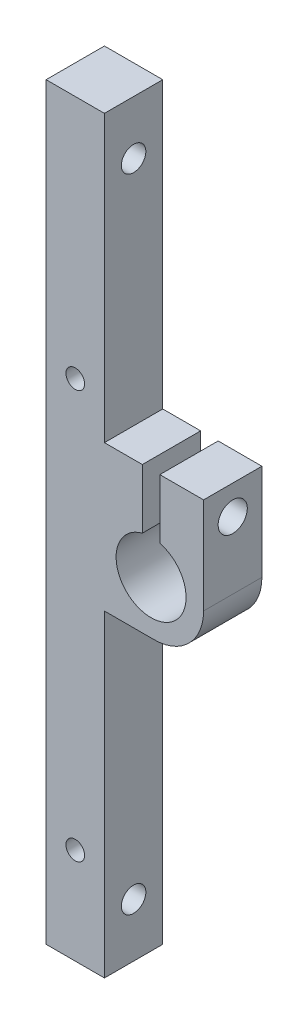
from build123d import *

# Parameters (mm, degrees)
SKETCH_1_W          = 10
SKETCH_1_H          = 149
EXTRUDE_1_DEPTH     = 10
SKETCH_2_R          = 2.1
CUT_EXTRUDE_1_DEPTH = 10
SKETCH_3_W          = 17
SKETCH_3_H          = 25
EXTRUDE_2_DEPTH     = 10
SKETCH_4_R          = 6
CUT_EXTRUDE_2_DEPTH = 10
FILLET_1_R          = 8.5
SKETCH_5_W          = 3
SKETCH_5_H          = 36.182387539
CUT_EXTRUDE_3_DEPTH = 152.756383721
SKETCH_6_R          = 1.6
CUT_EXTRUDE_4_DEPTH = 30
SKETCH_8_R          = 2.5
CUT_EXTRUDE_6_DEPTH = 7.5
SKETCH_9_W          = 66.344731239
SKETCH_9_H          = 52.466496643
CUT_EXTRUDE_7_DEPTH = 10
SKETCH_11_R         = 1.6
CUT_EXTRUDE_9_DEPTH = 132.58860133


with BuildPart() as part:
    # Sketch 1 → Extrude 1 (new body)
    with BuildSketch(Plane.XY):
        with Locations((5, 74.5)):
            Rectangle(SKETCH_1_W, SKETCH_1_H)
    extrude(amount=EXTRUDE_1_DEPTH)

    # Sketch 2 → Cut-Extrude 1 (cut)
    with BuildSketch(Plane(origin=(10, 0, 0), x_dir=(0, 0, -1), z_dir=(1, 0, 0))):
        with Locations((-5, 9.2)):
            Circle(SKETCH_2_R)
        with Locations((-5, 119.2)):
            Circle(SKETCH_2_R)
    extrude(amount=-CUT_EXTRUDE_1_DEPTH, mode=Mode.SUBTRACT)

    # Sketch 3 → Extrude 2 (add)
    with BuildSketch(Plane.XY.offset(10)):
        with Locations((18.5, 67)):
            Rectangle(SKETCH_3_W, SKETCH_3_H)
    extrude(amount=-EXTRUDE_2_DEPTH)

    # Sketch 4 → Cut-Extrude 2 (cut)
    with BuildSketch(Plane.XY.offset(10)):
        with Locations((18, 63.5)):
            Circle(SKETCH_4_R)
    extrude(amount=-CUT_EXTRUDE_2_DEPTH, mode=Mode.SUBTRACT)

    # Fillet 1
    fillet_1_edges = [part.edges().sort_by_distance(p)[0] for p in [
        (27, 54.5, 5),
    ]]
    fillet(fillet_1_edges, radius=FILLET_1_R)

    # Sketch 5 → Cut-Extrude 3 (cut, through all)
    with BuildSketch(Plane.XY.offset(10)):
        with Locations((18, 82.549021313)):
            Rectangle(SKETCH_5_W, SKETCH_5_H)
    extrude(amount=-CUT_EXTRUDE_3_DEPTH, mode=Mode.SUBTRACT)

    # Sketch 6 → Cut-Extrude 4 (cut)
    with BuildSketch(Plane(origin=(27, 0, 0), x_dir=(0, 0, -1), z_dir=(1, 0, 0))):
        with Locations(Location((-5, 74.5, 0), (0, 0, 180))):
            Circle(SKETCH_6_R)
    extrude(amount=-CUT_EXTRUDE_4_DEPTH, mode=Mode.SUBTRACT)

    # Sketch 8 → Cut-Extrude 6 (cut)
    with BuildSketch(Plane(origin=(27, 0, 0), x_dir=(0, 0, -1), z_dir=(1, 0, 0))):
        with Locations(Location((-5, 74.5, 0), (0, 0, 90))):
            Circle(SKETCH_8_R)
    extrude(amount=-CUT_EXTRUDE_6_DEPTH, mode=Mode.SUBTRACT)

    # Sketch 9 → Cut-Extrude 7 (cut)
    with BuildSketch(Plane.XY.offset(10)):
        with Locations((16.207948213, 154.633248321)):
            Rectangle(SKETCH_9_W, SKETCH_9_H)
    extrude(amount=-CUT_EXTRUDE_7_DEPTH, mode=Mode.SUBTRACT)

    # Sketch 11 → Cut-Extrude 9 (cut, through all)
    with BuildSketch(Plane(origin=(0, 0, 0), x_dir=(-1, 0, 0), z_dir=(0, 0, -1))):
        with Locations((-5, 86.5)):
            Circle(SKETCH_11_R)
        with Locations((-5, 16.5)):
            Circle(SKETCH_11_R)
    extrude(amount=-CUT_EXTRUDE_9_DEPTH, mode=Mode.SUBTRACT)


solid = part.part
